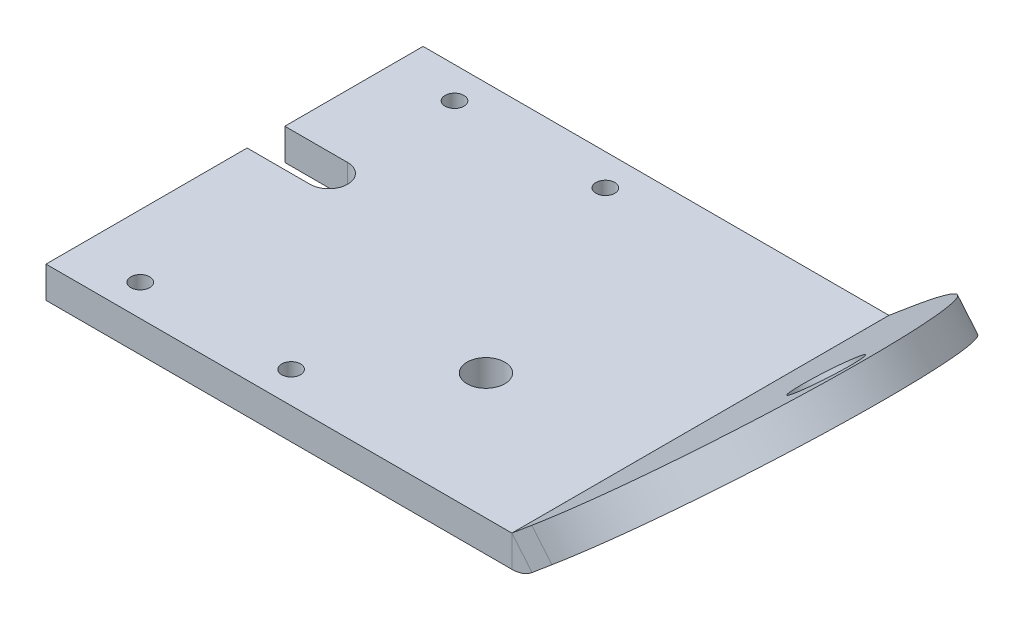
ISO-10303-21;
HEADER;
FILE_DESCRIPTION(('STEP AP214'),'2;1');
FILE_NAME('part.step','',(''),(''),'','','');
FILE_SCHEMA(('AUTOMOTIVE_DESIGN { 1 0 10303 214 1 1 1 1 }'));
ENDSEC;
DATA;
#1=APPLICATION_CONTEXT('core data for automotive mechanical design processes');
#2=APPLICATION_PROTOCOL_DEFINITION('international standard','automotive_design',2000,#1);
#3=PRODUCT_CONTEXT('',#1,'mechanical');
#4=PRODUCT('Part','Part','',(#3));
#5=PRODUCT_RELATED_PRODUCT_CATEGORY('part','',(#4));
#6=PRODUCT_DEFINITION_FORMATION('','',#4);
#7=PRODUCT_DEFINITION_CONTEXT('part definition',#1,'design');
#8=PRODUCT_DEFINITION('design','',#6,#7);
#9=PRODUCT_DEFINITION_SHAPE('','',#8);
#10=(LENGTH_UNIT() NAMED_UNIT(*) SI_UNIT(.MILLI.,.METRE.));
#11=(NAMED_UNIT(*) PLANE_ANGLE_UNIT() SI_UNIT($,.RADIAN.));
#12=(NAMED_UNIT(*) SI_UNIT($,.STERADIAN.) SOLID_ANGLE_UNIT());
#13=UNCERTAINTY_MEASURE_WITH_UNIT(LENGTH_MEASURE(1.E-05),#10,'distance_accuracy_value','');
#14=(GEOMETRIC_REPRESENTATION_CONTEXT(3) GLOBAL_UNCERTAINTY_ASSIGNED_CONTEXT((#13)) GLOBAL_UNIT_ASSIGNED_CONTEXT((#10,
#11,#12)) REPRESENTATION_CONTEXT('',''));
#15=CARTESIAN_POINT('',(0.,0.,0.));
#16=DIRECTION('',(0.,0.,1.));
#17=DIRECTION('',(1.,0.,0.));
#18=AXIS2_PLACEMENT_3D('',#15,#16,#17);
#19=CARTESIAN_POINT('',(23.6662099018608,-37.3420368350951,-35.));
#20=DIRECTION('',(-0.642787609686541,0.766044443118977,0.));
#21=DIRECTION('',(0.,0.,1.));
#22=AXIS2_PLACEMENT_3D('',#19,#20,#21);
#23=PLANE('',#22);
#24=CARTESIAN_POINT('',(94.1422986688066,21.7944232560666,-30.));
#25=DIRECTION('',(-0.642787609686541,0.766044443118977,0.));
#26=DIRECTION('',(0.,0.,1.));
#27=AXIS2_PLACEMENT_3D('',#24,#25,#26);
#28=CIRCLE('',#27,5.00000000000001);
#29=CARTESIAN_POINT('',(94.1422986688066,21.7944232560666,-25.));
#30=VERTEX_POINT('',#29);
#31=EDGE_CURVE('E169',#30,#30,#28,.T.);
#32=ORIENTED_EDGE('',*,*,#31,.F.);
#33=EDGE_LOOP('',(#32));
#34=FACE_BOUND('',#33,.T.);
#35=DIRECTION('',(-0.766044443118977,-0.642787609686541,0.));
#36=VECTOR('',#35,1.);
#37=CARTESIAN_POINT('',(16.005765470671,-43.7699129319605,-60.));
#38=LINE('',#37,#36);
#39=CARTESIAN_POINT('',(77.2893209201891,7.65309584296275,-60.));
#40=VERTEX_POINT('',#39);
#41=CARTESIAN_POINT('',(74.1302726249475,5.00233951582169,-60.));
#42=VERTEX_POINT('',#41);
#43=EDGE_CURVE('E42',#40,#42,#38,.T.);
#44=ORIENTED_EDGE('',*,*,#43,.T.);
#45=DIRECTION('',(0.,0.,1.));
#46=VECTOR('',#45,1.);
#47=CARTESIAN_POINT('',(74.1302725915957,5.00233955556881,-35.));
#48=LINE('',#47,#46);
#49=CARTESIAN_POINT('',(74.1302725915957,5.00233955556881,0.));
#50=VERTEX_POINT('',#49);
#51=EDGE_CURVE('E139',#42,#50,#48,.T.);
#52=ORIENTED_EDGE('',*,*,#51,.T.);
#53=DIRECTION('',(0.766044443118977,0.642787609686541,0.));
#54=VECTOR('',#53,1.);
#55=CARTESIAN_POINT('',(16.005765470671,-43.7699129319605,0.));
#56=LINE('',#55,#54);
#57=CARTESIAN_POINT('',(77.2893209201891,7.65309584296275,0.));
#58=VERTEX_POINT('',#57);
#59=EDGE_CURVE('E158',#50,#58,#56,.T.);
#60=ORIENTED_EDGE('',*,*,#59,.T.);
#61=CARTESIAN_POINT('',(77.2893209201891,7.65309584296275,-30.));
#62=DIRECTION('',(-0.642787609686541,0.766044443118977,0.));
#63=DIRECTION('',(0.,0.,1.));
#64=AXIS2_PLACEMENT_3D('',#61,#62,#63);
#65=CIRCLE('',#64,30.);
#66=EDGE_CURVE('E62',#58,#40,#65,.T.);
#67=ORIENTED_EDGE('',*,*,#66,.T.);
#68=EDGE_LOOP('',(#44,#52,#60,#67));
#69=FACE_BOUND('',#68,.T.);
#70=ADVANCED_FACE('F38',(#34,#69),#23,.T.);
#71=CARTESIAN_POINT('',(26.8801479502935,-41.1722590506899,-35.));
#72=DIRECTION('',(-0.642787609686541,0.766044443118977,0.));
#73=DIRECTION('',(0.,0.,1.));
#74=AXIS2_PLACEMENT_3D('',#71,#72,#73);
#75=PLANE('',#74);
#76=DIRECTION('',(0.,0.,1.));
#77=VECTOR('',#76,1.);
#78=CARTESIAN_POINT('',(77.3442106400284,1.17211733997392,-35.));
#79=LINE('',#78,#77);
#80=CARTESIAN_POINT('',(77.3442106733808,1.17211730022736,-60.));
#81=VERTEX_POINT('',#80);
#82=CARTESIAN_POINT('',(77.3442106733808,1.17211730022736,0.));
#83=VERTEX_POINT('',#82);
#84=EDGE_CURVE('E47',#81,#83,#79,.T.);
#85=ORIENTED_EDGE('',*,*,#84,.F.);
#86=DIRECTION('',(-0.766044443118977,-0.642787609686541,0.));
#87=VECTOR('',#86,1.);
#88=CARTESIAN_POINT('',(19.2197035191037,-47.6001351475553,-60.));
#89=LINE('',#88,#87);
#90=CARTESIAN_POINT('',(80.5032589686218,3.82287362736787,-60.));
#91=VERTEX_POINT('',#90);
#92=EDGE_CURVE('E153',#91,#81,#89,.T.);
#93=ORIENTED_EDGE('',*,*,#92,.F.);
#94=CARTESIAN_POINT('',(80.5032589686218,3.82287362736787,-30.));
#95=DIRECTION('',(-0.642787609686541,0.766044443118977,0.));
#96=DIRECTION('',(0.,0.,1.));
#97=AXIS2_PLACEMENT_3D('',#94,#95,#96);
#98=CIRCLE('',#97,30.);
#99=CARTESIAN_POINT('',(80.5032589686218,3.82287362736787,0.));
#100=VERTEX_POINT('',#99);
#101=EDGE_CURVE('E159',#100,#91,#98,.T.);
#102=ORIENTED_EDGE('',*,*,#101,.F.);
#103=DIRECTION('',(0.766044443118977,0.642787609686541,0.));
#104=VECTOR('',#103,1.);
#105=CARTESIAN_POINT('',(19.2197035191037,-47.6001351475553,0.));
#106=LINE('',#105,#104);
#107=EDGE_CURVE('E164',#83,#100,#106,.T.);
#108=ORIENTED_EDGE('',*,*,#107,.F.);
#109=EDGE_LOOP('',(#85,#93,#102,#108));
#110=FACE_BOUND('',#109,.T.);
#111=CARTESIAN_POINT('',(97.3562367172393,17.9642010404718,-30.));
#112=DIRECTION('',(-0.642787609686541,0.766044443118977,0.));
#113=DIRECTION('',(0.,0.,1.));
#114=AXIS2_PLACEMENT_3D('',#111,#112,#113);
#115=CIRCLE('',#114,5.00000000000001);
#116=CARTESIAN_POINT('',(97.3562367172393,17.9642010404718,-25.));
#117=VERTEX_POINT('',#116);
#118=EDGE_CURVE('E201',#117,#117,#115,.T.);
#119=ORIENTED_EDGE('',*,*,#118,.T.);
#120=EDGE_LOOP('',(#119));
#121=FACE_BOUND('',#120,.T.);
#122=ADVANCED_FACE('F162',(#110,#121),#75,.F.);
#123=CARTESIAN_POINT('',(16.005765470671,-43.7699129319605,0.));
#124=DIRECTION('',(0.,0.,-1.));
#125=DIRECTION('',(-0.766044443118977,-0.642787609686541,0.));
#126=AXIS2_PLACEMENT_3D('',#123,#124,#125);
#127=PLANE('',#126);
#128=DIRECTION('',(-0.642787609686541,0.766044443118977,0.));
#129=VECTOR('',#128,1.);
#130=CARTESIAN_POINT('',(74.1302725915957,5.00233955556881,0.));
#131=LINE('',#130,#129);
#132=EDGE_CURVE('E12',#83,#50,#131,.T.);
#133=ORIENTED_EDGE('',*,*,#132,.F.);
#134=ORIENTED_EDGE('',*,*,#107,.T.);
#135=DIRECTION('',(0.642787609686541,-0.766044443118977,0.));
#136=VECTOR('',#135,1.);
#137=CARTESIAN_POINT('',(77.2893209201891,7.65309584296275,0.));
#138=LINE('',#137,#136);
#139=EDGE_CURVE('E178',#58,#100,#138,.T.);
#140=ORIENTED_EDGE('',*,*,#139,.F.);
#141=ORIENTED_EDGE('',*,*,#59,.F.);
#142=EDGE_LOOP('',(#133,#134,#140,#141));
#143=FACE_BOUND('',#142,.T.);
#144=ADVANCED_FACE('F40',(#143),#127,.F.);
#145=CARTESIAN_POINT('',(77.2893209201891,7.65309584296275,-30.));
#146=DIRECTION('',(0.642787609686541,-0.766044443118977,0.));
#147=DIRECTION('',(0.,0.,-1.));
#148=AXIS2_PLACEMENT_3D('',#145,#146,#147);
#149=CYLINDRICAL_SURFACE('',#148,30.);
#150=ORIENTED_EDGE('',*,*,#101,.T.);
#151=DIRECTION('',(0.642787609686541,-0.766044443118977,0.));
#152=VECTOR('',#151,1.);
#153=CARTESIAN_POINT('',(77.2893209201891,7.65309584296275,-60.));
#154=LINE('',#153,#152);
#155=EDGE_CURVE('E155',#40,#91,#154,.T.);
#156=ORIENTED_EDGE('',*,*,#155,.F.);
#157=ORIENTED_EDGE('',*,*,#66,.F.);
#158=ORIENTED_EDGE('',*,*,#139,.T.);
#159=EDGE_LOOP('',(#150,#156,#157,#158));
#160=FACE_BOUND('',#159,.T.);
#161=ADVANCED_FACE('F182',(#160),#149,.T.);
#162=CARTESIAN_POINT('',(16.005765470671,-43.7699129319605,-60.));
#163=DIRECTION('',(0.,0.,1.));
#164=DIRECTION('',(0.766044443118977,0.642787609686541,0.));
#165=AXIS2_PLACEMENT_3D('',#162,#163,#164);
#166=PLANE('',#165);
#167=DIRECTION('',(0.642787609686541,-0.766044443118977,0.));
#168=VECTOR('',#167,1.);
#169=CARTESIAN_POINT('',(74.1302725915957,5.00233955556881,-60.));
#170=LINE('',#169,#168);
#171=EDGE_CURVE('E129',#42,#81,#170,.T.);
#172=ORIENTED_EDGE('',*,*,#171,.F.);
#173=ORIENTED_EDGE('',*,*,#43,.F.);
#174=ORIENTED_EDGE('',*,*,#155,.T.);
#175=ORIENTED_EDGE('',*,*,#92,.T.);
#176=EDGE_LOOP('',(#172,#173,#174,#175));
#177=FACE_BOUND('',#176,.T.);
#178=ADVANCED_FACE('F154',(#177),#166,.F.);
#179=CARTESIAN_POINT('',(94.1422986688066,21.7944232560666,-30.));
#180=DIRECTION('',(0.642787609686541,-0.766044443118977,0.));
#181=DIRECTION('',(0.,0.,-1.));
#182=AXIS2_PLACEMENT_3D('',#179,#180,#181);
#183=CYLINDRICAL_SURFACE('',#182,5.00000000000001);
#184=ORIENTED_EDGE('',*,*,#31,.T.);
#185=EDGE_LOOP('',(#184));
#186=FACE_BOUND('',#185,.T.);
#187=ORIENTED_EDGE('',*,*,#118,.F.);
#188=EDGE_LOOP('',(#187));
#189=FACE_BOUND('',#188,.T.);
#190=ADVANCED_FACE('F189',(#186,#189),#183,.F.);
#191=CARTESIAN_POINT('',(10.,5.,-5.));
#192=DIRECTION('',(0.,-1.,0.));
#193=DIRECTION('',(0.,0.,-1.));
#194=AXIS2_PLACEMENT_3D('',#191,#192,#193);
#195=CYLINDRICAL_SURFACE('',#194,1.5);
#196=CARTESIAN_POINT('',(10.,5.,-5.));
#197=DIRECTION('',(0.,1.,0.));
#198=DIRECTION('',(0.,0.,1.));
#199=AXIS2_PLACEMENT_3D('',#196,#197,#198);
#200=CIRCLE('',#199,1.5);
#201=CARTESIAN_POINT('',(10.,5.,-3.5));
#202=VERTEX_POINT('',#201);
#203=EDGE_CURVE('E208',#202,#202,#200,.T.);
#204=ORIENTED_EDGE('',*,*,#203,.T.);
#205=EDGE_LOOP('',(#204));
#206=FACE_BOUND('',#205,.T.);
#207=CARTESIAN_POINT('',(10.,0.,-5.));
#208=DIRECTION('',(0.,1.,0.));
#209=DIRECTION('',(0.,0.,1.));
#210=AXIS2_PLACEMENT_3D('',#207,#208,#209);
#211=CIRCLE('',#210,1.5);
#212=CARTESIAN_POINT('',(10.,0.,-3.5));
#213=VERTEX_POINT('',#212);
#214=EDGE_CURVE('E270',#213,#213,#211,.T.);
#215=ORIENTED_EDGE('',*,*,#214,.F.);
#216=EDGE_LOOP('',(#215));
#217=FACE_BOUND('',#216,.T.);
#218=ADVANCED_FACE('F353',(#206,#217),#195,.F.);
#219=CARTESIAN_POINT('',(10.,5.,-55.));
#220=DIRECTION('',(0.,-1.,0.));
#221=DIRECTION('',(0.,0.,-1.));
#222=AXIS2_PLACEMENT_3D('',#219,#220,#221);
#223=CYLINDRICAL_SURFACE('',#222,1.5);
#224=CARTESIAN_POINT('',(10.,5.,-55.));
#225=DIRECTION('',(0.,1.,0.));
#226=DIRECTION('',(0.,0.,1.));
#227=AXIS2_PLACEMENT_3D('',#224,#225,#226);
#228=CIRCLE('',#227,1.5);
#229=CARTESIAN_POINT('',(10.,5.,-53.5));
#230=VERTEX_POINT('',#229);
#231=EDGE_CURVE('E211',#230,#230,#228,.T.);
#232=ORIENTED_EDGE('',*,*,#231,.T.);
#233=EDGE_LOOP('',(#232));
#234=FACE_BOUND('',#233,.T.);
#235=CARTESIAN_POINT('',(10.,0.,-55.));
#236=DIRECTION('',(0.,1.,0.));
#237=DIRECTION('',(0.,0.,1.));
#238=AXIS2_PLACEMENT_3D('',#235,#236,#237);
#239=CIRCLE('',#238,1.5);
#240=CARTESIAN_POINT('',(10.,0.,-53.5));
#241=VERTEX_POINT('',#240);
#242=EDGE_CURVE('E273',#241,#241,#239,.T.);
#243=ORIENTED_EDGE('',*,*,#242,.F.);
#244=EDGE_LOOP('',(#243));
#245=FACE_BOUND('',#244,.T.);
#246=ADVANCED_FACE('F357',(#234,#245),#223,.F.);
#247=CARTESIAN_POINT('',(50.,5.,-20.));
#248=DIRECTION('',(0.,-1.,0.));
#249=DIRECTION('',(0.,0.,-1.));
#250=AXIS2_PLACEMENT_3D('',#247,#248,#249);
#251=CYLINDRICAL_SURFACE('',#250,3.);
#252=CARTESIAN_POINT('',(50.,5.,-20.));
#253=DIRECTION('',(0.,1.,0.));
#254=DIRECTION('',(0.,0.,1.));
#255=AXIS2_PLACEMENT_3D('',#252,#253,#254);
#256=CIRCLE('',#255,3.);
#257=CARTESIAN_POINT('',(50.,5.,-17.));
#258=VERTEX_POINT('',#257);
#259=EDGE_CURVE('E214',#258,#258,#256,.T.);
#260=ORIENTED_EDGE('',*,*,#259,.T.);
#261=EDGE_LOOP('',(#260));
#262=FACE_BOUND('',#261,.T.);
#263=CARTESIAN_POINT('',(50.,0.,-20.));
#264=DIRECTION('',(0.,1.,0.));
#265=DIRECTION('',(0.,0.,1.));
#266=AXIS2_PLACEMENT_3D('',#263,#264,#265);
#267=CIRCLE('',#266,3.);
#268=CARTESIAN_POINT('',(50.,0.,-17.));
#269=VERTEX_POINT('',#268);
#270=EDGE_CURVE('E276',#269,#269,#267,.T.);
#271=ORIENTED_EDGE('',*,*,#270,.F.);
#272=EDGE_LOOP('',(#271));
#273=FACE_BOUND('',#272,.T.);
#274=ADVANCED_FACE('F365',(#262,#273),#251,.F.);
#275=CARTESIAN_POINT('',(34.,5.,-55.));
#276=DIRECTION('',(0.,-1.,0.));
#277=DIRECTION('',(0.,0.,-1.));
#278=AXIS2_PLACEMENT_3D('',#275,#276,#277);
#279=CYLINDRICAL_SURFACE('',#278,1.5);
#280=CARTESIAN_POINT('',(34.,5.,-55.));
#281=DIRECTION('',(0.,1.,0.));
#282=DIRECTION('',(0.,0.,1.));
#283=AXIS2_PLACEMENT_3D('',#280,#281,#282);
#284=CIRCLE('',#283,1.5);
#285=CARTESIAN_POINT('',(34.,5.,-53.5));
#286=VERTEX_POINT('',#285);
#287=EDGE_CURVE('E217',#286,#286,#284,.T.);
#288=ORIENTED_EDGE('',*,*,#287,.T.);
#289=EDGE_LOOP('',(#288));
#290=FACE_BOUND('',#289,.T.);
#291=CARTESIAN_POINT('',(34.,0.,-55.));
#292=DIRECTION('',(0.,1.,0.));
#293=DIRECTION('',(0.,0.,1.));
#294=AXIS2_PLACEMENT_3D('',#291,#292,#293);
#295=CIRCLE('',#294,1.5);
#296=CARTESIAN_POINT('',(34.,0.,-53.5));
#297=VERTEX_POINT('',#296);
#298=EDGE_CURVE('E279',#297,#297,#295,.T.);
#299=ORIENTED_EDGE('',*,*,#298,.F.);
#300=EDGE_LOOP('',(#299));
#301=FACE_BOUND('',#300,.T.);
#302=ADVANCED_FACE('F374',(#290,#301),#279,.F.);
#303=CARTESIAN_POINT('',(34.,5.,-5.));
#304=DIRECTION('',(0.,-1.,0.));
#305=DIRECTION('',(0.,0.,-1.));
#306=AXIS2_PLACEMENT_3D('',#303,#304,#305);
#307=CYLINDRICAL_SURFACE('',#306,1.5);
#308=CARTESIAN_POINT('',(34.,5.,-5.));
#309=DIRECTION('',(0.,1.,0.));
#310=DIRECTION('',(0.,0.,1.));
#311=AXIS2_PLACEMENT_3D('',#308,#309,#310);
#312=CIRCLE('',#311,1.5);
#313=CARTESIAN_POINT('',(34.,5.,-3.5));
#314=VERTEX_POINT('',#313);
#315=EDGE_CURVE('E220',#314,#314,#312,.T.);
#316=ORIENTED_EDGE('',*,*,#315,.T.);
#317=EDGE_LOOP('',(#316));
#318=FACE_BOUND('',#317,.T.);
#319=CARTESIAN_POINT('',(34.,0.,-5.));
#320=DIRECTION('',(0.,1.,0.));
#321=DIRECTION('',(0.,0.,1.));
#322=AXIS2_PLACEMENT_3D('',#319,#320,#321);
#323=CIRCLE('',#322,1.5);
#324=CARTESIAN_POINT('',(34.,0.,-3.5));
#325=VERTEX_POINT('',#324);
#326=EDGE_CURVE('E282',#325,#325,#323,.T.);
#327=ORIENTED_EDGE('',*,*,#326,.F.);
#328=EDGE_LOOP('',(#327));
#329=FACE_BOUND('',#328,.T.);
#330=ADVANCED_FACE('F378',(#318,#329),#307,.F.);
#331=CARTESIAN_POINT('',(0.,5.,0.));
#332=DIRECTION('',(1.,0.,0.));
#333=DIRECTION('',(0.,0.,-1.));
#334=AXIS2_PLACEMENT_3D('',#331,#332,#333);
#335=PLANE('',#334);
#336=DIRECTION('',(0.,0.,1.));
#337=VECTOR('',#336,1.);
#338=CARTESIAN_POINT('',(0.,0.,0.));
#339=LINE('',#338,#337);
#340=CARTESIAN_POINT('',(0.,0.,-32.));
#341=VERTEX_POINT('',#340);
#342=CARTESIAN_POINT('',(0.,0.,0.));
#343=VERTEX_POINT('',#342);
#344=EDGE_CURVE('E223',#341,#343,#339,.T.);
#345=ORIENTED_EDGE('',*,*,#344,.T.);
#346=DIRECTION('',(0.,-1.,0.));
#347=VECTOR('',#346,1.);
#348=CARTESIAN_POINT('',(0.,5.,0.));
#349=LINE('',#348,#347);
#350=CARTESIAN_POINT('',(0.,5.,0.));
#351=VERTEX_POINT('',#350);
#352=EDGE_CURVE('E203',#351,#343,#349,.T.);
#353=ORIENTED_EDGE('',*,*,#352,.F.);
#354=DIRECTION('',(0.,0.,1.));
#355=VECTOR('',#354,1.);
#356=CARTESIAN_POINT('',(0.,5.,0.));
#357=LINE('',#356,#355);
#358=CARTESIAN_POINT('',(0.,5.,-32.));
#359=VERTEX_POINT('',#358);
#360=EDGE_CURVE('E259',#359,#351,#357,.T.);
#361=ORIENTED_EDGE('',*,*,#360,.F.);
#362=DIRECTION('',(0.,-1.,0.));
#363=VECTOR('',#362,1.);
#364=CARTESIAN_POINT('',(0.,5.,-32.));
#365=LINE('',#364,#363);
#366=EDGE_CURVE('E226',#359,#341,#365,.T.);
#367=ORIENTED_EDGE('',*,*,#366,.T.);
#368=EDGE_LOOP('',(#345,#353,#361,#367));
#369=FACE_BOUND('',#368,.T.);
#370=ADVANCED_FACE('F319',(#369),#335,.F.);
#371=CARTESIAN_POINT('',(0.,5.,-32.));
#372=DIRECTION('',(0.,0.,1.));
#373=DIRECTION('',(1.,0.,0.));
#374=AXIS2_PLACEMENT_3D('',#371,#372,#373);
#375=PLANE('',#374);
#376=DIRECTION('',(-1.,0.,0.));
#377=VECTOR('',#376,1.);
#378=CARTESIAN_POINT('',(0.,0.,-32.));
#379=LINE('',#378,#377);
#380=CARTESIAN_POINT('',(10.,0.,-32.));
#381=VERTEX_POINT('',#380);
#382=EDGE_CURVE('E229',#381,#341,#379,.T.);
#383=ORIENTED_EDGE('',*,*,#382,.T.);
#384=ORIENTED_EDGE('',*,*,#366,.F.);
#385=DIRECTION('',(-1.,0.,0.));
#386=VECTOR('',#385,1.);
#387=CARTESIAN_POINT('',(0.,5.,-32.));
#388=LINE('',#387,#386);
#389=CARTESIAN_POINT('',(10.,5.,-32.));
#390=VERTEX_POINT('',#389);
#391=EDGE_CURVE('E257',#390,#359,#388,.T.);
#392=ORIENTED_EDGE('',*,*,#391,.F.);
#393=DIRECTION('',(0.,-1.,0.));
#394=VECTOR('',#393,1.);
#395=CARTESIAN_POINT('',(10.,5.,-32.));
#396=LINE('',#395,#394);
#397=EDGE_CURVE('E231',#390,#381,#396,.T.);
#398=ORIENTED_EDGE('',*,*,#397,.T.);
#399=EDGE_LOOP('',(#383,#384,#392,#398));
#400=FACE_BOUND('',#399,.T.);
#401=ADVANCED_FACE('F323',(#400),#375,.F.);
#402=CARTESIAN_POINT('',(10.,5.,-35.));
#403=DIRECTION('',(0.,-1.,0.));
#404=DIRECTION('',(0.,0.,-1.));
#405=AXIS2_PLACEMENT_3D('',#402,#403,#404);
#406=CYLINDRICAL_SURFACE('',#405,3.);
#407=CARTESIAN_POINT('',(10.,0.,-35.));
#408=DIRECTION('',(0.,-1.,0.));
#409=DIRECTION('',(0.,0.,1.));
#410=AXIS2_PLACEMENT_3D('',#407,#408,#409);
#411=CIRCLE('',#410,3.);
#412=CARTESIAN_POINT('',(10.,0.,-38.));
#413=VERTEX_POINT('',#412);
#414=EDGE_CURVE('E234',#413,#381,#411,.T.);
#415=ORIENTED_EDGE('',*,*,#414,.T.);
#416=ORIENTED_EDGE('',*,*,#397,.F.);
#417=CARTESIAN_POINT('',(10.,5.,-35.));
#418=DIRECTION('',(0.,-1.,0.));
#419=DIRECTION('',(0.,0.,1.));
#420=AXIS2_PLACEMENT_3D('',#417,#418,#419);
#421=CIRCLE('',#420,3.);
#422=CARTESIAN_POINT('',(10.,5.,-38.));
#423=VERTEX_POINT('',#422);
#424=EDGE_CURVE('E255',#423,#390,#421,.T.);
#425=ORIENTED_EDGE('',*,*,#424,.F.);
#426=DIRECTION('',(0.,-1.,0.));
#427=VECTOR('',#426,1.);
#428=CARTESIAN_POINT('',(10.,5.,-38.));
#429=LINE('',#428,#427);
#430=EDGE_CURVE('E236',#423,#413,#429,.T.);
#431=ORIENTED_EDGE('',*,*,#430,.T.);
#432=EDGE_LOOP('',(#415,#416,#425,#431));
#433=FACE_BOUND('',#432,.T.);
#434=ADVANCED_FACE('F327',(#433),#406,.F.);
#435=CARTESIAN_POINT('',(0.,5.,-38.));
#436=DIRECTION('',(0.,0.,-1.));
#437=DIRECTION('',(-1.,0.,0.));
#438=AXIS2_PLACEMENT_3D('',#435,#436,#437);
#439=PLANE('',#438);
#440=DIRECTION('',(1.,0.,0.));
#441=VECTOR('',#440,1.);
#442=CARTESIAN_POINT('',(0.,0.,-38.));
#443=LINE('',#442,#441);
#444=CARTESIAN_POINT('',(0.,0.,-38.));
#445=VERTEX_POINT('',#444);
#446=EDGE_CURVE('E239',#445,#413,#443,.T.);
#447=ORIENTED_EDGE('',*,*,#446,.T.);
#448=ORIENTED_EDGE('',*,*,#430,.F.);
#449=DIRECTION('',(1.,0.,0.));
#450=VECTOR('',#449,1.);
#451=CARTESIAN_POINT('',(0.,5.,-38.));
#452=LINE('',#451,#450);
#453=CARTESIAN_POINT('',(0.,5.,-38.));
#454=VERTEX_POINT('',#453);
#455=EDGE_CURVE('E253',#454,#423,#452,.T.);
#456=ORIENTED_EDGE('',*,*,#455,.F.);
#457=DIRECTION('',(0.,-1.,0.));
#458=VECTOR('',#457,1.);
#459=CARTESIAN_POINT('',(0.,5.,-38.));
#460=LINE('',#459,#458);
#461=EDGE_CURVE('E241',#454,#445,#460,.T.);
#462=ORIENTED_EDGE('',*,*,#461,.T.);
#463=EDGE_LOOP('',(#447,#448,#456,#462));
#464=FACE_BOUND('',#463,.T.);
#465=ADVANCED_FACE('F331',(#464),#439,.F.);
#466=CARTESIAN_POINT('',(0.,5.,-38.));
#467=DIRECTION('',(1.,0.,0.));
#468=DIRECTION('',(0.,0.,-1.));
#469=AXIS2_PLACEMENT_3D('',#466,#467,#468);
#470=PLANE('',#469);
#471=DIRECTION('',(0.,0.,1.));
#472=VECTOR('',#471,1.);
#473=CARTESIAN_POINT('',(0.,0.,-38.));
#474=LINE('',#473,#472);
#475=CARTESIAN_POINT('',(0.,0.,-60.));
#476=VERTEX_POINT('',#475);
#477=EDGE_CURVE('E244',#476,#445,#474,.T.);
#478=ORIENTED_EDGE('',*,*,#477,.T.);
#479=ORIENTED_EDGE('',*,*,#461,.F.);
#480=DIRECTION('',(0.,0.,1.));
#481=VECTOR('',#480,1.);
#482=CARTESIAN_POINT('',(0.,5.,-38.));
#483=LINE('',#482,#481);
#484=CARTESIAN_POINT('',(0.,5.,-60.));
#485=VERTEX_POINT('',#484);
#486=EDGE_CURVE('E251',#485,#454,#483,.T.);
#487=ORIENTED_EDGE('',*,*,#486,.F.);
#488=DIRECTION('',(0.,-1.,0.));
#489=VECTOR('',#488,1.);
#490=CARTESIAN_POINT('',(0.,5.,-60.));
#491=LINE('',#490,#489);
#492=EDGE_CURVE('E246',#485,#476,#491,.T.);
#493=ORIENTED_EDGE('',*,*,#492,.T.);
#494=EDGE_LOOP('',(#478,#479,#487,#493));
#495=FACE_BOUND('',#494,.T.);
#496=ADVANCED_FACE('F335',(#495),#470,.F.);
#497=CARTESIAN_POINT('',(10.,5.,-35.));
#498=DIRECTION('',(0.,1.,0.));
#499=DIRECTION('',(0.,0.,1.));
#500=AXIS2_PLACEMENT_3D('',#497,#498,#499);
#501=PLANE('',#500);
#502=DIRECTION('',(0.,0.,1.));
#503=VECTOR('',#502,1.);
#504=CARTESIAN_POINT('',(74.1238447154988,5.,-35.));
#505=LINE('',#504,#503);
#506=CARTESIAN_POINT('',(74.1238447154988,4.99999995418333,-60.));
#507=VERTEX_POINT('',#506);
#508=CARTESIAN_POINT('',(74.1238447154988,4.99999994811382,0.));
#509=VERTEX_POINT('',#508);
#510=EDGE_CURVE('E206',#507,#509,#505,.T.);
#511=ORIENTED_EDGE('',*,*,#510,.F.);
#512=DIRECTION('',(-1.,0.,0.));
#513=VECTOR('',#512,1.);
#514=CARTESIAN_POINT('',(0.,5.,-60.));
#515=LINE('',#514,#513);
#516=EDGE_CURVE('E249',#507,#485,#515,.T.);
#517=ORIENTED_EDGE('',*,*,#516,.T.);
#518=ORIENTED_EDGE('',*,*,#486,.T.);
#519=ORIENTED_EDGE('',*,*,#455,.T.);
#520=ORIENTED_EDGE('',*,*,#424,.T.);
#521=ORIENTED_EDGE('',*,*,#391,.T.);
#522=ORIENTED_EDGE('',*,*,#360,.T.);
#523=DIRECTION('',(1.,0.,0.));
#524=VECTOR('',#523,1.);
#525=CARTESIAN_POINT('',(0.,5.,0.));
#526=LINE('',#525,#524);
#527=EDGE_CURVE('E262',#351,#509,#526,.T.);
#528=ORIENTED_EDGE('',*,*,#527,.T.);
#529=EDGE_LOOP('',(#511,#517,#518,#519,#520,#521,#522,#528));
#530=FACE_BOUND('',#529,.T.);
#531=ORIENTED_EDGE('',*,*,#315,.F.);
#532=EDGE_LOOP('',(#531));
#533=FACE_BOUND('',#532,.T.);
#534=ORIENTED_EDGE('',*,*,#287,.F.);
#535=EDGE_LOOP('',(#534));
#536=FACE_BOUND('',#535,.T.);
#537=ORIENTED_EDGE('',*,*,#259,.F.);
#538=EDGE_LOOP('',(#537));
#539=FACE_BOUND('',#538,.T.);
#540=ORIENTED_EDGE('',*,*,#231,.F.);
#541=EDGE_LOOP('',(#540));
#542=FACE_BOUND('',#541,.T.);
#543=ORIENTED_EDGE('',*,*,#203,.F.);
#544=EDGE_LOOP('',(#543));
#545=FACE_BOUND('',#544,.T.);
#546=ADVANCED_FACE('F313',(#530,#533,#536,#539,#542,#545),#501,.T.);
#547=CARTESIAN_POINT('',(0.,5.,-60.));
#548=DIRECTION('',(0.,0.,1.));
#549=DIRECTION('',(1.,0.,0.));
#550=AXIS2_PLACEMENT_3D('',#547,#548,#549);
#551=PLANE('',#550);
#552=ORIENTED_EDGE('',*,*,#516,.F.);
#553=DIRECTION('',(0.,-1.,0.));
#554=VECTOR('',#553,1.);
#555=CARTESIAN_POINT('',(74.1238447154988,5.,-60.));
#556=LINE('',#555,#554);
#557=CARTESIAN_POINT('',(74.1238447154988,0.,-60.));
#558=VERTEX_POINT('',#557);
#559=EDGE_CURVE('E265',#507,#558,#556,.T.);
#560=ORIENTED_EDGE('',*,*,#559,.T.);
#561=DIRECTION('',(-1.,0.,0.));
#562=VECTOR('',#561,1.);
#563=CARTESIAN_POINT('',(0.,0.,-60.));
#564=LINE('',#563,#562);
#565=EDGE_CURVE('E268',#558,#476,#564,.T.);
#566=ORIENTED_EDGE('',*,*,#565,.T.);
#567=ORIENTED_EDGE('',*,*,#492,.F.);
#568=EDGE_LOOP('',(#552,#560,#566,#567));
#569=FACE_BOUND('',#568,.T.);
#570=ADVANCED_FACE('F309',(#569),#551,.F.);
#571=CARTESIAN_POINT('',(10.,0.,-35.));
#572=DIRECTION('',(0.,1.,0.));
#573=DIRECTION('',(0.,0.,1.));
#574=AXIS2_PLACEMENT_3D('',#571,#572,#573);
#575=PLANE('',#574);
#576=ORIENTED_EDGE('',*,*,#214,.T.);
#577=EDGE_LOOP('',(#576));
#578=FACE_BOUND('',#577,.T.);
#579=ORIENTED_EDGE('',*,*,#242,.T.);
#580=EDGE_LOOP('',(#579));
#581=FACE_BOUND('',#580,.T.);
#582=ORIENTED_EDGE('',*,*,#270,.T.);
#583=EDGE_LOOP('',(#582));
#584=FACE_BOUND('',#583,.T.);
#585=ORIENTED_EDGE('',*,*,#298,.T.);
#586=EDGE_LOOP('',(#585));
#587=FACE_BOUND('',#586,.T.);
#588=ORIENTED_EDGE('',*,*,#326,.T.);
#589=EDGE_LOOP('',(#588));
#590=FACE_BOUND('',#589,.T.);
#591=ORIENTED_EDGE('',*,*,#565,.F.);
#592=DIRECTION('',(0.,0.,1.));
#593=VECTOR('',#592,1.);
#594=CARTESIAN_POINT('',(74.1238447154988,0.,-35.));
#595=LINE('',#594,#593);
#596=CARTESIAN_POINT('',(74.1238447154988,-5.18861767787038E-08,0.));
#597=VERTEX_POINT('',#596);
#598=EDGE_CURVE('E147',#558,#597,#595,.T.);
#599=ORIENTED_EDGE('',*,*,#598,.T.);
#600=DIRECTION('',(1.,0.,0.));
#601=VECTOR('',#600,1.);
#602=CARTESIAN_POINT('',(0.,0.,0.));
#603=LINE('',#602,#601);
#604=EDGE_CURVE('E286',#343,#597,#603,.T.);
#605=ORIENTED_EDGE('',*,*,#604,.F.);
#606=ORIENTED_EDGE('',*,*,#344,.F.);
#607=ORIENTED_EDGE('',*,*,#382,.F.);
#608=ORIENTED_EDGE('',*,*,#414,.F.);
#609=ORIENTED_EDGE('',*,*,#446,.F.);
#610=ORIENTED_EDGE('',*,*,#477,.F.);
#611=EDGE_LOOP('',(#591,#599,#605,#606,#607,#608,#609,#610));
#612=FACE_BOUND('',#611,.T.);
#613=ADVANCED_FACE('F303',(#578,#581,#584,#587,#590,#612),#575,.F.);
#614=CARTESIAN_POINT('',(0.,5.,0.));
#615=DIRECTION('',(0.,0.,-1.));
#616=DIRECTION('',(-1.,0.,0.));
#617=AXIS2_PLACEMENT_3D('',#614,#615,#616);
#618=PLANE('',#617);
#619=ORIENTED_EDGE('',*,*,#604,.T.);
#620=DIRECTION('',(0.,1.,0.));
#621=VECTOR('',#620,1.);
#622=CARTESIAN_POINT('',(74.1238447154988,5.,0.));
#623=LINE('',#622,#621);
#624=EDGE_CURVE('E289',#597,#509,#623,.T.);
#625=ORIENTED_EDGE('',*,*,#624,.T.);
#626=ORIENTED_EDGE('',*,*,#527,.F.);
#627=ORIENTED_EDGE('',*,*,#352,.T.);
#628=EDGE_LOOP('',(#619,#625,#626,#627));
#629=FACE_BOUND('',#628,.T.);
#630=ADVANCED_FACE('F299',(#629),#618,.F.);
#631=CARTESIAN_POINT('',(74.1238447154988,5.01000005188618,-60.));
#632=DIRECTION('',(0.,0.,1.));
#633=DIRECTION('',(1.,0.,0.));
#634=AXIS2_PLACEMENT_3D('',#631,#632,#633);
#635=PLANE('',#634);
#636=ORIENTED_EDGE('',*,*,#171,.T.);
#637=CARTESIAN_POINT('',(74.1238447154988,5.01,-60.));
#638=DIRECTION('',(0.,0.,-1.));
#639=DIRECTION('',(-1.,0.,0.));
#640=AXIS2_PLACEMENT_3D('',#637,#638,#639);
#641=CIRCLE('',#640,5.01000005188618);
#642=EDGE_CURVE('E132',#81,#558,#641,.T.);
#643=ORIENTED_EDGE('',*,*,#642,.T.);
#644=ORIENTED_EDGE('',*,*,#559,.F.);
#645=CARTESIAN_POINT('',(74.1238447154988,5.01000005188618,-60.));
#646=DIRECTION('',(0.,0.,-1.));
#647=DIRECTION('',(-1.,0.,0.));
#648=AXIS2_PLACEMENT_3D('',#645,#646,#647);
#649=CIRCLE('',#648,0.0100000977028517);
#650=EDGE_CURVE('E135',#42,#507,#649,.T.);
#651=ORIENTED_EDGE('',*,*,#650,.F.);
#652=EDGE_LOOP('',(#636,#643,#644,#651));
#653=FACE_BOUND('',#652,.T.);
#654=ADVANCED_FACE('F131',(#653),#635,.F.);
#655=CARTESIAN_POINT('',(74.1238447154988,5.01000005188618,0.));
#656=DIRECTION('',(0.,0.,-1.));
#657=DIRECTION('',(-1.,0.,0.));
#658=AXIS2_PLACEMENT_3D('',#655,#656,#657);
#659=PLANE('',#658);
#660=CARTESIAN_POINT('',(74.1238447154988,5.01,0.));
#661=DIRECTION('',(0.,0.,-1.));
#662=DIRECTION('',(-1.,0.,0.));
#663=AXIS2_PLACEMENT_3D('',#660,#661,#662);
#664=CIRCLE('',#663,5.01000005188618);
#665=EDGE_CURVE('E149',#597,#83,#664,.F.);
#666=ORIENTED_EDGE('',*,*,#665,.T.);
#667=ORIENTED_EDGE('',*,*,#132,.T.);
#668=CARTESIAN_POINT('',(74.1238447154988,5.01000005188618,0.));
#669=DIRECTION('',(0.,0.,1.));
#670=DIRECTION('',(1.,0.,0.));
#671=AXIS2_PLACEMENT_3D('',#668,#669,#670);
#672=CIRCLE('',#671,0.0100000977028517);
#673=EDGE_CURVE('E55',#509,#50,#672,.T.);
#674=ORIENTED_EDGE('',*,*,#673,.F.);
#675=ORIENTED_EDGE('',*,*,#624,.F.);
#676=EDGE_LOOP('',(#666,#667,#674,#675));
#677=FACE_BOUND('',#676,.T.);
#678=ADVANCED_FACE('F297',(#677),#659,.F.);
#679=CARTESIAN_POINT('',(74.1238447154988,5.01,30.2334673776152));
#680=DIRECTION('',(0.,0.,-1.));
#681=DIRECTION('',(-1.,0.,0.));
#682=AXIS2_PLACEMENT_3D('',#679,#680,#681);
#683=CYLINDRICAL_SURFACE('',#682,0.0100000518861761);
#684=ORIENTED_EDGE('',*,*,#510,.T.);
#685=ORIENTED_EDGE('',*,*,#673,.T.);
#686=ORIENTED_EDGE('',*,*,#51,.F.);
#687=ORIENTED_EDGE('',*,*,#650,.T.);
#688=EDGE_LOOP('',(#684,#685,#686,#687));
#689=FACE_BOUND('',#688,.T.);
#690=ADVANCED_FACE('F311',(#689),#683,.F.);
#691=CARTESIAN_POINT('',(74.1238447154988,5.01,30.2334673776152));
#692=DIRECTION('',(0.,0.,-1.));
#693=DIRECTION('',(-1.,0.,0.));
#694=AXIS2_PLACEMENT_3D('',#691,#692,#693);
#695=CYLINDRICAL_SURFACE('',#694,5.01000005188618);
#696=ORIENTED_EDGE('',*,*,#598,.F.);
#697=ORIENTED_EDGE('',*,*,#642,.F.);
#698=ORIENTED_EDGE('',*,*,#84,.T.);
#699=ORIENTED_EDGE('',*,*,#665,.F.);
#700=EDGE_LOOP('',(#696,#697,#698,#699));
#701=FACE_BOUND('',#700,.T.);
#702=ADVANCED_FACE('F142',(#701),#695,.T.);
#703=CLOSED_SHELL('',(#70,#122,#144,#161,#178,#190,#218,#246,#274,#302,#330,#370,#401,#434,#465,
#496,#546,#570,#613,#630,#654,#678,#690,#702));
#704=MANIFOLD_SOLID_BREP('B2',#703);
#705=ADVANCED_BREP_SHAPE_REPRESENTATION('',(#18,#704),#14);
#706=SHAPE_DEFINITION_REPRESENTATION(#9,#705);
ENDSEC;
END-ISO-10303-21;
